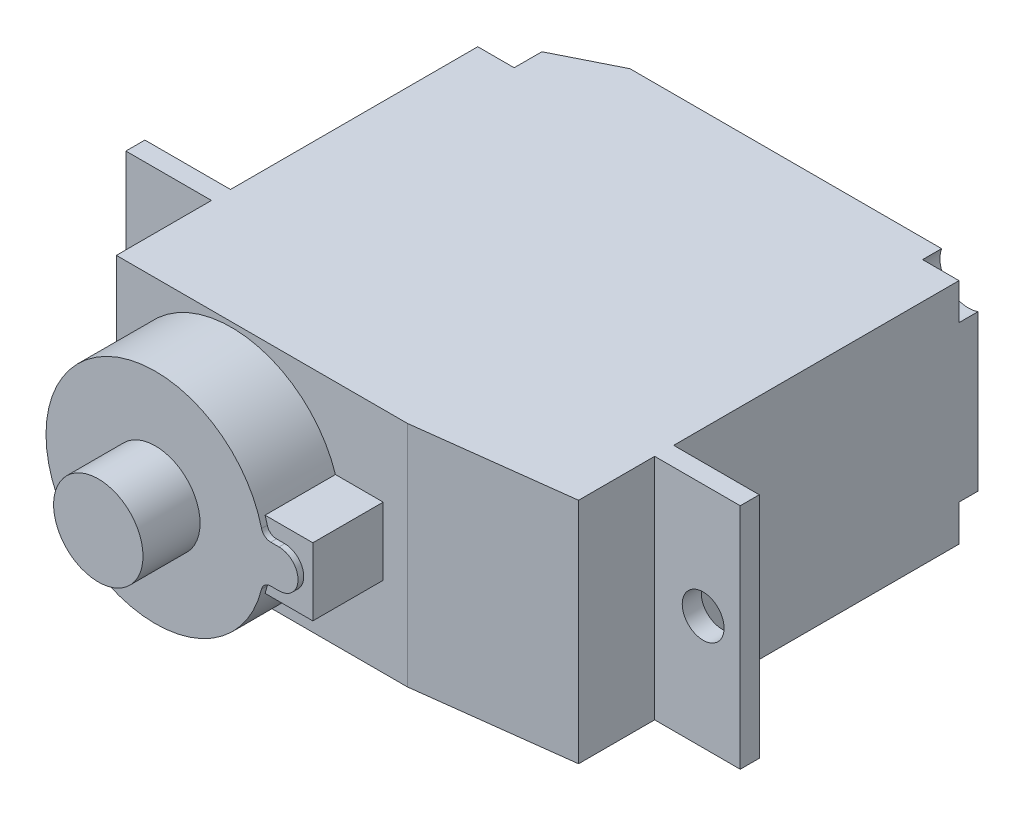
ISO-10303-21;
HEADER;
FILE_DESCRIPTION(('STEP AP214'),'2;1');
FILE_NAME('part.step','',(''),(''),'','','');
FILE_SCHEMA(('AUTOMOTIVE_DESIGN { 1 0 10303 214 1 1 1 1 }'));
ENDSEC;
DATA;
#1=APPLICATION_CONTEXT('core data for automotive mechanical design processes');
#2=APPLICATION_PROTOCOL_DEFINITION('international standard','automotive_design',2000,#1);
#3=PRODUCT_CONTEXT('',#1,'mechanical');
#4=PRODUCT('Part','Part','',(#3));
#5=PRODUCT_RELATED_PRODUCT_CATEGORY('part','',(#4));
#6=PRODUCT_DEFINITION_FORMATION('','',#4);
#7=PRODUCT_DEFINITION_CONTEXT('part definition',#1,'design');
#8=PRODUCT_DEFINITION('design','',#6,#7);
#9=PRODUCT_DEFINITION_SHAPE('','',#8);
#10=(LENGTH_UNIT() NAMED_UNIT(*) SI_UNIT(.MILLI.,.METRE.));
#11=(NAMED_UNIT(*) PLANE_ANGLE_UNIT() SI_UNIT($,.RADIAN.));
#12=(NAMED_UNIT(*) SI_UNIT($,.STERADIAN.) SOLID_ANGLE_UNIT());
#13=UNCERTAINTY_MEASURE_WITH_UNIT(LENGTH_MEASURE(1.E-05),#10,'distance_accuracy_value','');
#14=(GEOMETRIC_REPRESENTATION_CONTEXT(3) GLOBAL_UNCERTAINTY_ASSIGNED_CONTEXT((#13)) GLOBAL_UNIT_ASSIGNED_CONTEXT((#10,
#11,#12)) REPRESENTATION_CONTEXT('',''));
#15=CARTESIAN_POINT('',(0.,0.,0.));
#16=DIRECTION('',(0.,0.,1.));
#17=DIRECTION('',(1.,0.,0.));
#18=AXIS2_PLACEMENT_3D('',#15,#16,#17);
#19=CARTESIAN_POINT('',(0.467330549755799,-1.5,10.));
#20=DIRECTION('',(0.,0.,1.));
#21=DIRECTION('',(1.,0.,0.));
#22=AXIS2_PLACEMENT_3D('',#19,#20,#21);
#23=PLANE('',#22);
#24=CARTESIAN_POINT('',(0.467330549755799,-1.5,10.));
#25=DIRECTION('',(0.,0.,-1.));
#26=DIRECTION('',(1.,0.,0.));
#27=AXIS2_PLACEMENT_3D('',#24,#25,#26);
#28=CIRCLE('',#27,0.5);
#29=CARTESIAN_POINT('',(-0.018055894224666,-1.38,10.));
#30=VERTEX_POINT('',#29);
#31=CARTESIAN_POINT('',(0.467330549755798,-1.,10.));
#32=VERTEX_POINT('',#31);
#33=EDGE_CURVE('E699',#30,#32,#28,.T.);
#34=ORIENTED_EDGE('',*,*,#33,.T.);
#35=DIRECTION('',(1.,0.,0.));
#36=VECTOR('',#35,1.);
#37=CARTESIAN_POINT('',(0.9,-1.,10.));
#38=LINE('',#37,#36);
#39=CARTESIAN_POINT('',(0.9,-1.,10.));
#40=VERTEX_POINT('',#39);
#41=EDGE_CURVE('E708',#32,#40,#38,.T.);
#42=ORIENTED_EDGE('',*,*,#41,.T.);
#43=CARTESIAN_POINT('',(0.9,0.,10.));
#44=DIRECTION('',(0.,0.,1.));
#45=DIRECTION('',(1.,0.,0.));
#46=AXIS2_PLACEMENT_3D('',#43,#44,#45);
#47=CIRCLE('',#46,1.);
#48=CARTESIAN_POINT('',(0.9,1.,10.));
#49=VERTEX_POINT('',#48);
#50=EDGE_CURVE('E706',#40,#49,#47,.T.);
#51=ORIENTED_EDGE('',*,*,#50,.T.);
#52=DIRECTION('',(-1.,0.,0.));
#53=VECTOR('',#52,1.);
#54=CARTESIAN_POINT('',(0.9,1.,10.));
#55=LINE('',#54,#53);
#56=CARTESIAN_POINT('',(0.467330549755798,1.,10.));
#57=VERTEX_POINT('',#56);
#58=EDGE_CURVE('E704',#49,#57,#55,.T.);
#59=ORIENTED_EDGE('',*,*,#58,.T.);
#60=CARTESIAN_POINT('',(0.467330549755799,1.5,10.));
#61=DIRECTION('',(0.,0.,-1.));
#62=DIRECTION('',(-1.,0.,0.));
#63=AXIS2_PLACEMENT_3D('',#60,#61,#62);
#64=CIRCLE('',#63,0.5);
#65=CARTESIAN_POINT('',(-0.0180558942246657,1.38,10.));
#66=VERTEX_POINT('',#65);
#67=EDGE_CURVE('E702',#57,#66,#64,.T.);
#68=ORIENTED_EDGE('',*,*,#67,.T.);
#69=CARTESIAN_POINT('',(-5.6,0.,10.));
#70=DIRECTION('',(0.,0.,1.));
#71=DIRECTION('',(1.,0.,0.));
#72=AXIS2_PLACEMENT_3D('',#69,#70,#71);
#73=CIRCLE('',#72,5.75);
#74=EDGE_CURVE('E695',#66,#30,#73,.T.);
#75=ORIENTED_EDGE('',*,*,#74,.T.);
#76=EDGE_LOOP('',(#34,#42,#51,#59,#68,#75));
#77=FACE_BOUND('',#76,.T.);
#78=CARTESIAN_POINT('',(-5.59999999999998,0.,10.));
#79=DIRECTION('',(0.,0.,1.));
#80=DIRECTION('',(1.,0.,0.));
#81=AXIS2_PLACEMENT_3D('',#78,#79,#80);
#82=CIRCLE('',#81,2.35);
#83=CARTESIAN_POINT('',(-3.24999999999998,0.,10.));
#84=VERTEX_POINT('',#83);
#85=EDGE_CURVE('E405',#84,#84,#82,.T.);
#86=ORIENTED_EDGE('',*,*,#85,.F.);
#87=EDGE_LOOP('',(#86));
#88=FACE_BOUND('',#87,.T.);
#89=ADVANCED_FACE('F34',(#77,#88),#23,.T.);
#90=CARTESIAN_POINT('',(11.65,6.,0.));
#91=DIRECTION('',(0.,0.,-1.));
#92=DIRECTION('',(-1.,0.,0.));
#93=AXIS2_PLACEMENT_3D('',#90,#91,#92);
#94=PLANE('',#93);
#95=DIRECTION('',(0.,-1.,0.));
#96=VECTOR('',#95,1.);
#97=CARTESIAN_POINT('',(11.65,6.,0.));
#98=LINE('',#97,#96);
#99=CARTESIAN_POINT('',(11.65,6.,0.));
#100=VERTEX_POINT('',#99);
#101=CARTESIAN_POINT('',(11.65,-6.,0.));
#102=VERTEX_POINT('',#101);
#103=EDGE_CURVE('E355',#100,#102,#98,.T.);
#104=ORIENTED_EDGE('',*,*,#103,.F.);
#105=DIRECTION('',(-1.,0.,0.));
#106=VECTOR('',#105,1.);
#107=CARTESIAN_POINT('',(-11.65,6.,0.));
#108=LINE('',#107,#106);
#109=CARTESIAN_POINT('',(16.15,6.,0.));
#110=VERTEX_POINT('',#109);
#111=EDGE_CURVE('E546',#110,#100,#108,.T.);
#112=ORIENTED_EDGE('',*,*,#111,.F.);
#113=DIRECTION('',(0.,1.,0.));
#114=VECTOR('',#113,1.);
#115=CARTESIAN_POINT('',(16.15,6.,0.));
#116=LINE('',#115,#114);
#117=CARTESIAN_POINT('',(16.15,-6.,0.));
#118=VERTEX_POINT('',#117);
#119=EDGE_CURVE('E587',#118,#110,#116,.T.);
#120=ORIENTED_EDGE('',*,*,#119,.F.);
#121=DIRECTION('',(1.,0.,0.));
#122=VECTOR('',#121,1.);
#123=CARTESIAN_POINT('',(-11.65,-6.,0.));
#124=LINE('',#123,#122);
#125=EDGE_CURVE('E369',#102,#118,#124,.T.);
#126=ORIENTED_EDGE('',*,*,#125,.F.);
#127=EDGE_LOOP('',(#104,#112,#120,#126));
#128=FACE_BOUND('',#127,.T.);
#129=CARTESIAN_POINT('',(14.2,0.,0.));
#130=DIRECTION('',(0.,0.,-1.));
#131=DIRECTION('',(-1.,0.,0.));
#132=AXIS2_PLACEMENT_3D('',#129,#130,#131);
#133=CIRCLE('',#132,1.1);
#134=CARTESIAN_POINT('',(13.1,0.,0.));
#135=VERTEX_POINT('',#134);
#136=EDGE_CURVE('E662',#135,#135,#133,.T.);
#137=ORIENTED_EDGE('',*,*,#136,.F.);
#138=EDGE_LOOP('',(#137));
#139=FACE_BOUND('',#138,.T.);
#140=ADVANCED_FACE('F420',(#128,#139),#94,.T.);
#141=CARTESIAN_POINT('',(11.65,6.,6.));
#142=DIRECTION('',(0.,0.,-1.));
#143=DIRECTION('',(-1.,0.,0.));
#144=AXIS2_PLACEMENT_3D('',#141,#142,#143);
#145=PLANE('',#144);
#146=DIRECTION('',(1.,0.,0.));
#147=VECTOR('',#146,1.);
#148=CARTESIAN_POINT('',(-11.65,-6.,6.));
#149=LINE('',#148,#147);
#150=CARTESIAN_POINT('',(-11.65,-6.,6.));
#151=VERTEX_POINT('',#150);
#152=CARTESIAN_POINT('',(3.65,-6.,6.));
#153=VERTEX_POINT('',#152);
#154=EDGE_CURVE('E560',#151,#153,#149,.T.);
#155=ORIENTED_EDGE('',*,*,#154,.T.);
#156=DIRECTION('',(0.,1.,0.));
#157=VECTOR('',#156,1.);
#158=CARTESIAN_POINT('',(3.65,6.,6.));
#159=LINE('',#158,#157);
#160=CARTESIAN_POINT('',(3.65,6.,6.));
#161=VERTEX_POINT('',#160);
#162=EDGE_CURVE('E763',#153,#161,#159,.T.);
#163=ORIENTED_EDGE('',*,*,#162,.T.);
#164=DIRECTION('',(-1.,0.,0.));
#165=VECTOR('',#164,1.);
#166=CARTESIAN_POINT('',(-11.65,6.,6.));
#167=LINE('',#166,#165);
#168=CARTESIAN_POINT('',(-11.65,6.,6.));
#169=VERTEX_POINT('',#168);
#170=EDGE_CURVE('E569',#161,#169,#167,.T.);
#171=ORIENTED_EDGE('',*,*,#170,.T.);
#172=DIRECTION('',(0.,-1.,0.));
#173=VECTOR('',#172,1.);
#174=CARTESIAN_POINT('',(-11.65,-6.,6.));
#175=LINE('',#174,#173);
#176=EDGE_CURVE('E572',#169,#151,#175,.T.);
#177=ORIENTED_EDGE('',*,*,#176,.T.);
#178=EDGE_LOOP('',(#155,#163,#171,#177));
#179=FACE_BOUND('',#178,.T.);
#180=DIRECTION('',(-1.,0.,0.));
#181=VECTOR('',#180,1.);
#182=CARTESIAN_POINT('',(-0.333342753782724,1.77889036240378,6.));
#183=LINE('',#182,#181);
#184=CARTESIAN_POINT('',(2.3789392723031,1.77889036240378,6.));
#185=VERTEX_POINT('',#184);
#186=CARTESIAN_POINT('',(-0.13208914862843,1.77889036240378,6.));
#187=VERTEX_POINT('',#186);
#188=EDGE_CURVE('E736',#185,#187,#183,.T.);
#189=ORIENTED_EDGE('',*,*,#188,.F.);
#190=DIRECTION('',(0.,1.,0.));
#191=VECTOR('',#190,1.);
#192=CARTESIAN_POINT('',(2.3789392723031,-1.77889036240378,6.));
#193=LINE('',#192,#191);
#194=CARTESIAN_POINT('',(2.3789392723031,-1.77889036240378,6.));
#195=VERTEX_POINT('',#194);
#196=EDGE_CURVE('E388',#195,#185,#193,.T.);
#197=ORIENTED_EDGE('',*,*,#196,.F.);
#198=DIRECTION('',(1.,0.,0.));
#199=VECTOR('',#198,1.);
#200=CARTESIAN_POINT('',(-0.333342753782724,-1.77889036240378,6.));
#201=LINE('',#200,#199);
#202=CARTESIAN_POINT('',(-0.13208914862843,-1.77889036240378,6.));
#203=VERTEX_POINT('',#202);
#204=EDGE_CURVE('E732',#203,#195,#201,.T.);
#205=ORIENTED_EDGE('',*,*,#204,.F.);
#206=CARTESIAN_POINT('',(-5.6,0.,6.));
#207=DIRECTION('',(0.,0.,1.));
#208=DIRECTION('',(1.,0.,0.));
#209=AXIS2_PLACEMENT_3D('',#206,#207,#208);
#210=CIRCLE('',#209,5.75);
#211=EDGE_CURVE('E696',#187,#203,#210,.T.);
#212=ORIENTED_EDGE('',*,*,#211,.F.);
#213=EDGE_LOOP('',(#189,#197,#205,#212));
#214=FACE_BOUND('',#213,.T.);
#215=ADVANCED_FACE('F426',(#179,#214),#145,.F.);
#216=CARTESIAN_POINT('',(0.467330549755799,-1.5,10.));
#217=DIRECTION('',(0.,0.,-1.));
#218=DIRECTION('',(-1.,0.,0.));
#219=AXIS2_PLACEMENT_3D('',#216,#217,#218);
#220=CYLINDRICAL_SURFACE('',#219,0.5);
#221=CARTESIAN_POINT('',(0.467330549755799,-1.5,9.7));
#222=DIRECTION('',(0.,0.,-1.));
#223=DIRECTION('',(-1.,0.,0.));
#224=AXIS2_PLACEMENT_3D('',#221,#222,#223);
#225=CIRCLE('',#224,0.5);
#226=CARTESIAN_POINT('',(0.467330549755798,-1.,9.7));
#227=VERTEX_POINT('',#226);
#228=CARTESIAN_POINT('',(-0.018055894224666,-1.38,9.7));
#229=VERTEX_POINT('',#228);
#230=EDGE_CURVE('E722',#227,#229,#225,.F.);
#231=ORIENTED_EDGE('',*,*,#230,.F.);
#232=DIRECTION('',(0.,0.,-1.));
#233=VECTOR('',#232,1.);
#234=CARTESIAN_POINT('',(0.467330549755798,-1.,10.));
#235=LINE('',#234,#233);
#236=EDGE_CURVE('E677',#32,#227,#235,.T.);
#237=ORIENTED_EDGE('',*,*,#236,.F.);
#238=ORIENTED_EDGE('',*,*,#33,.F.);
#239=DIRECTION('',(0.,0.,-1.));
#240=VECTOR('',#239,1.);
#241=CARTESIAN_POINT('',(-0.018055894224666,-1.38,10.));
#242=LINE('',#241,#240);
#243=EDGE_CURVE('E692',#30,#229,#242,.T.);
#244=ORIENTED_EDGE('',*,*,#243,.T.);
#245=EDGE_LOOP('',(#231,#237,#238,#244));
#246=FACE_BOUND('',#245,.T.);
#247=ADVANCED_FACE('F455',(#246),#220,.F.);
#248=CARTESIAN_POINT('',(0.9,-1.,10.));
#249=DIRECTION('',(0.,1.,0.));
#250=DIRECTION('',(-1.,0.,0.));
#251=AXIS2_PLACEMENT_3D('',#248,#249,#250);
#252=PLANE('',#251);
#253=DIRECTION('',(-1.,0.,0.));
#254=VECTOR('',#253,1.);
#255=CARTESIAN_POINT('',(0.9,-1.,9.7));
#256=LINE('',#255,#254);
#257=CARTESIAN_POINT('',(0.9,-1.,9.7));
#258=VERTEX_POINT('',#257);
#259=EDGE_CURVE('E719',#258,#227,#256,.T.);
#260=ORIENTED_EDGE('',*,*,#259,.F.);
#261=DIRECTION('',(0.,0.,-1.));
#262=VECTOR('',#261,1.);
#263=CARTESIAN_POINT('',(0.9,-1.,10.));
#264=LINE('',#263,#262);
#265=EDGE_CURVE('E680',#40,#258,#264,.T.);
#266=ORIENTED_EDGE('',*,*,#265,.F.);
#267=ORIENTED_EDGE('',*,*,#41,.F.);
#268=ORIENTED_EDGE('',*,*,#236,.T.);
#269=EDGE_LOOP('',(#260,#266,#267,#268));
#270=FACE_BOUND('',#269,.T.);
#271=ADVANCED_FACE('F451',(#270),#252,.F.);
#272=CARTESIAN_POINT('',(0.9,0.,10.));
#273=DIRECTION('',(0.,0.,-1.));
#274=DIRECTION('',(-1.,0.,0.));
#275=AXIS2_PLACEMENT_3D('',#272,#273,#274);
#276=CYLINDRICAL_SURFACE('',#275,1.);
#277=CARTESIAN_POINT('',(0.9,0.,9.7));
#278=DIRECTION('',(0.,0.,-1.));
#279=DIRECTION('',(-1.,0.,0.));
#280=AXIS2_PLACEMENT_3D('',#277,#278,#279);
#281=CIRCLE('',#280,1.);
#282=CARTESIAN_POINT('',(0.9,1.,9.7));
#283=VERTEX_POINT('',#282);
#284=EDGE_CURVE('E716',#283,#258,#281,.T.);
#285=ORIENTED_EDGE('',*,*,#284,.F.);
#286=DIRECTION('',(0.,0.,-1.));
#287=VECTOR('',#286,1.);
#288=CARTESIAN_POINT('',(0.9,1.,10.));
#289=LINE('',#288,#287);
#290=EDGE_CURVE('E683',#49,#283,#289,.T.);
#291=ORIENTED_EDGE('',*,*,#290,.F.);
#292=ORIENTED_EDGE('',*,*,#50,.F.);
#293=ORIENTED_EDGE('',*,*,#265,.T.);
#294=EDGE_LOOP('',(#285,#291,#292,#293));
#295=FACE_BOUND('',#294,.T.);
#296=ADVANCED_FACE('F447',(#295),#276,.T.);
#297=CARTESIAN_POINT('',(0.9,1.,10.));
#298=DIRECTION('',(0.,-1.,0.));
#299=DIRECTION('',(1.,0.,0.));
#300=AXIS2_PLACEMENT_3D('',#297,#298,#299);
#301=PLANE('',#300);
#302=DIRECTION('',(1.,0.,0.));
#303=VECTOR('',#302,1.);
#304=CARTESIAN_POINT('',(0.9,1.,9.7));
#305=LINE('',#304,#303);
#306=CARTESIAN_POINT('',(0.467330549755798,1.,9.7));
#307=VERTEX_POINT('',#306);
#308=EDGE_CURVE('E713',#307,#283,#305,.T.);
#309=ORIENTED_EDGE('',*,*,#308,.F.);
#310=DIRECTION('',(0.,0.,-1.));
#311=VECTOR('',#310,1.);
#312=CARTESIAN_POINT('',(0.467330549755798,1.,10.));
#313=LINE('',#312,#311);
#314=EDGE_CURVE('E686',#57,#307,#313,.T.);
#315=ORIENTED_EDGE('',*,*,#314,.F.);
#316=ORIENTED_EDGE('',*,*,#58,.F.);
#317=ORIENTED_EDGE('',*,*,#290,.T.);
#318=EDGE_LOOP('',(#309,#315,#316,#317));
#319=FACE_BOUND('',#318,.T.);
#320=ADVANCED_FACE('F443',(#319),#301,.F.);
#321=CARTESIAN_POINT('',(0.467330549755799,1.5,10.));
#322=DIRECTION('',(0.,0.,-1.));
#323=DIRECTION('',(-1.,0.,0.));
#324=AXIS2_PLACEMENT_3D('',#321,#322,#323);
#325=CYLINDRICAL_SURFACE('',#324,0.5);
#326=CARTESIAN_POINT('',(0.467330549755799,1.5,9.7));
#327=DIRECTION('',(0.,0.,-1.));
#328=DIRECTION('',(-1.,0.,0.));
#329=AXIS2_PLACEMENT_3D('',#326,#327,#328);
#330=CIRCLE('',#329,0.5);
#331=CARTESIAN_POINT('',(-0.0180558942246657,1.38,9.7));
#332=VERTEX_POINT('',#331);
#333=EDGE_CURVE('E700',#332,#307,#330,.F.);
#334=ORIENTED_EDGE('',*,*,#333,.F.);
#335=DIRECTION('',(0.,0.,-1.));
#336=VECTOR('',#335,1.);
#337=CARTESIAN_POINT('',(-0.0180558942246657,1.38,10.));
#338=LINE('',#337,#336);
#339=EDGE_CURVE('E689',#66,#332,#338,.T.);
#340=ORIENTED_EDGE('',*,*,#339,.F.);
#341=ORIENTED_EDGE('',*,*,#67,.F.);
#342=ORIENTED_EDGE('',*,*,#314,.T.);
#343=EDGE_LOOP('',(#334,#340,#341,#342));
#344=FACE_BOUND('',#343,.T.);
#345=ADVANCED_FACE('F439',(#344),#325,.F.);
#346=CARTESIAN_POINT('',(-5.6,0.,10.));
#347=DIRECTION('',(0.,0.,-1.));
#348=DIRECTION('',(-1.,0.,0.));
#349=AXIS2_PLACEMENT_3D('',#346,#347,#348);
#350=CYLINDRICAL_SURFACE('',#349,5.75);
#351=DIRECTION('',(0.,0.,-1.));
#352=VECTOR('',#351,1.);
#353=CARTESIAN_POINT('',(-0.13208914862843,1.77889036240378,10.));
#354=LINE('',#353,#352);
#355=CARTESIAN_POINT('',(-0.13208914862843,1.77889036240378,9.7));
#356=VERTEX_POINT('',#355);
#357=EDGE_CURVE('E521',#187,#356,#354,.F.);
#358=ORIENTED_EDGE('',*,*,#357,.F.);
#359=ORIENTED_EDGE('',*,*,#211,.T.);
#360=DIRECTION('',(0.,0.,-1.));
#361=VECTOR('',#360,1.);
#362=CARTESIAN_POINT('',(-0.13208914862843,-1.77889036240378,10.));
#363=LINE('',#362,#361);
#364=CARTESIAN_POINT('',(-0.13208914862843,-1.77889036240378,9.7));
#365=VERTEX_POINT('',#364);
#366=EDGE_CURVE('E760',#365,#203,#363,.T.);
#367=ORIENTED_EDGE('',*,*,#366,.F.);
#368=CARTESIAN_POINT('',(-5.6,0.,9.7));
#369=DIRECTION('',(0.,0.,-1.));
#370=DIRECTION('',(-1.,0.,0.));
#371=AXIS2_PLACEMENT_3D('',#368,#369,#370);
#372=CIRCLE('',#371,5.75);
#373=EDGE_CURVE('E761',#229,#365,#372,.T.);
#374=ORIENTED_EDGE('',*,*,#373,.F.);
#375=ORIENTED_EDGE('',*,*,#243,.F.);
#376=ORIENTED_EDGE('',*,*,#74,.F.);
#377=ORIENTED_EDGE('',*,*,#339,.T.);
#378=EDGE_CURVE('E526',#356,#332,#372,.T.);
#379=ORIENTED_EDGE('',*,*,#378,.F.);
#380=EDGE_LOOP('',(#358,#359,#367,#374,#375,#376,#377,#379));
#381=FACE_BOUND('',#380,.T.);
#382=ADVANCED_FACE('F435',(#381),#350,.T.);
#383=CARTESIAN_POINT('',(-11.65,-6.,6.));
#384=DIRECTION('',(1.,0.,0.));
#385=DIRECTION('',(0.,0.,-1.));
#386=AXIS2_PLACEMENT_3D('',#383,#384,#385);
#387=PLANE('',#386);
#388=DIRECTION('',(0.,1.,0.));
#389=VECTOR('',#388,1.);
#390=CARTESIAN_POINT('',(-11.65,-6.,0.999999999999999));
#391=LINE('',#390,#389);
#392=CARTESIAN_POINT('',(-11.65,-6.,0.999999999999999));
#393=VERTEX_POINT('',#392);
#394=CARTESIAN_POINT('',(-11.65,6.,1.));
#395=VERTEX_POINT('',#394);
#396=EDGE_CURVE('E609',#393,#395,#391,.T.);
#397=ORIENTED_EDGE('',*,*,#396,.F.);
#398=DIRECTION('',(0.,0.,-1.));
#399=VECTOR('',#398,1.);
#400=CARTESIAN_POINT('',(-11.65,-6.,6.));
#401=LINE('',#400,#399);
#402=EDGE_CURVE('E600',#151,#393,#401,.T.);
#403=ORIENTED_EDGE('',*,*,#402,.F.);
#404=ORIENTED_EDGE('',*,*,#176,.F.);
#405=DIRECTION('',(0.,0.,-1.));
#406=VECTOR('',#405,1.);
#407=CARTESIAN_POINT('',(-11.65,6.,6.));
#408=LINE('',#407,#406);
#409=EDGE_CURVE('E603',#169,#395,#408,.T.);
#410=ORIENTED_EDGE('',*,*,#409,.T.);
#411=EDGE_LOOP('',(#397,#403,#404,#410));
#412=FACE_BOUND('',#411,.T.);
#413=ADVANCED_FACE('F438',(#412),#387,.F.);
#414=CARTESIAN_POINT('',(11.65,-6.,6.));
#415=DIRECTION('',(-1.,0.,0.));
#416=DIRECTION('',(0.,0.,1.));
#417=AXIS2_PLACEMENT_3D('',#414,#415,#416);
#418=PLANE('',#417);
#419=DIRECTION('',(0.,0.,-1.));
#420=VECTOR('',#419,1.);
#421=CARTESIAN_POINT('',(11.65,6.,6.));
#422=LINE('',#421,#420);
#423=CARTESIAN_POINT('',(11.65,6.,5.));
#424=VERTEX_POINT('',#423);
#425=CARTESIAN_POINT('',(11.65,6.,0.999999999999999));
#426=VERTEX_POINT('',#425);
#427=EDGE_CURVE('E608',#424,#426,#422,.T.);
#428=ORIENTED_EDGE('',*,*,#427,.F.);
#429=DIRECTION('',(0.,-1.,0.));
#430=VECTOR('',#429,1.);
#431=CARTESIAN_POINT('',(11.65,10.,5.));
#432=LINE('',#431,#430);
#433=CARTESIAN_POINT('',(11.65,-6.,5.));
#434=VERTEX_POINT('',#433);
#435=EDGE_CURVE('E672',#424,#434,#432,.T.);
#436=ORIENTED_EDGE('',*,*,#435,.T.);
#437=DIRECTION('',(0.,0.,-1.));
#438=VECTOR('',#437,1.);
#439=CARTESIAN_POINT('',(11.65,-6.,6.));
#440=LINE('',#439,#438);
#441=CARTESIAN_POINT('',(11.65,-6.,0.999999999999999));
#442=VERTEX_POINT('',#441);
#443=EDGE_CURVE('E604',#434,#442,#440,.T.);
#444=ORIENTED_EDGE('',*,*,#443,.T.);
#445=DIRECTION('',(0.,-1.,0.));
#446=VECTOR('',#445,1.);
#447=CARTESIAN_POINT('',(11.65,6.,1.));
#448=LINE('',#447,#446);
#449=EDGE_CURVE('E583',#426,#442,#448,.T.);
#450=ORIENTED_EDGE('',*,*,#449,.F.);
#451=EDGE_LOOP('',(#428,#436,#444,#450));
#452=FACE_BOUND('',#451,.T.);
#453=ADVANCED_FACE('F36',(#452),#418,.F.);
#454=CARTESIAN_POINT('',(-11.65,6.,6.));
#455=DIRECTION('',(0.,-1.,0.));
#456=DIRECTION('',(0.,0.,-1.));
#457=AXIS2_PLACEMENT_3D('',#454,#455,#456);
#458=PLANE('',#457);
#459=DIRECTION('',(1.,0.,0.));
#460=VECTOR('',#459,1.);
#461=CARTESIAN_POINT('',(11.65,6.,-16.));
#462=LINE('',#461,#460);
#463=CARTESIAN_POINT('',(-6.65,6.,-16.));
#464=VERTEX_POINT('',#463);
#465=CARTESIAN_POINT('',(9.7357864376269,6.,-16.));
#466=VERTEX_POINT('',#465);
#467=EDGE_CURVE('E354',#464,#466,#462,.T.);
#468=ORIENTED_EDGE('',*,*,#467,.F.);
#469=DIRECTION('',(-0.894427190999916,0.,0.447213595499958));
#470=VECTOR('',#469,1.);
#471=CARTESIAN_POINT('',(-19.45,6.,-9.60000000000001));
#472=LINE('',#471,#470);
#473=CARTESIAN_POINT('',(-9.73578643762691,6.,-14.4571067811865));
#474=VERTEX_POINT('',#473);
#475=EDGE_CURVE('E305',#464,#474,#472,.T.);
#476=ORIENTED_EDGE('',*,*,#475,.T.);
#477=DIRECTION('',(0.,0.,-1.));
#478=VECTOR('',#477,1.);
#479=CARTESIAN_POINT('',(-9.73578643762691,6.,-13.));
#480=LINE('',#479,#478);
#481=CARTESIAN_POINT('',(-9.73578643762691,6.,-13.));
#482=VERTEX_POINT('',#481);
#483=EDGE_CURVE('E323',#474,#482,#480,.F.);
#484=ORIENTED_EDGE('',*,*,#483,.T.);
#485=DIRECTION('',(1.,0.,0.));
#486=VECTOR('',#485,1.);
#487=CARTESIAN_POINT('',(-11.65,6.,-13.));
#488=LINE('',#487,#486);
#489=CARTESIAN_POINT('',(-11.65,6.,-13.));
#490=VERTEX_POINT('',#489);
#491=EDGE_CURVE('E325',#490,#482,#488,.T.);
#492=ORIENTED_EDGE('',*,*,#491,.F.);
#493=DIRECTION('',(0.,0.,1.));
#494=VECTOR('',#493,1.);
#495=CARTESIAN_POINT('',(-11.65,6.,-16.));
#496=LINE('',#495,#494);
#497=CARTESIAN_POINT('',(-11.65,6.,0.));
#498=VERTEX_POINT('',#497);
#499=EDGE_CURVE('E377',#490,#498,#496,.T.);
#500=ORIENTED_EDGE('',*,*,#499,.T.);
#501=CARTESIAN_POINT('',(-16.15,6.,0.));
#502=VERTEX_POINT('',#501);
#503=EDGE_CURVE('E551',#498,#502,#108,.T.);
#504=ORIENTED_EDGE('',*,*,#503,.T.);
#505=DIRECTION('',(0.,0.,-1.));
#506=VECTOR('',#505,1.);
#507=CARTESIAN_POINT('',(-16.15,6.,1.));
#508=LINE('',#507,#506);
#509=CARTESIAN_POINT('',(-16.15,6.,1.));
#510=VERTEX_POINT('',#509);
#511=EDGE_CURVE('E654',#510,#502,#508,.T.);
#512=ORIENTED_EDGE('',*,*,#511,.F.);
#513=DIRECTION('',(1.,0.,0.));
#514=VECTOR('',#513,1.);
#515=CARTESIAN_POINT('',(-16.15,6.,1.));
#516=LINE('',#515,#514);
#517=EDGE_CURVE('E615',#510,#395,#516,.T.);
#518=ORIENTED_EDGE('',*,*,#517,.T.);
#519=ORIENTED_EDGE('',*,*,#409,.F.);
#520=ORIENTED_EDGE('',*,*,#170,.F.);
#521=DIRECTION('',(0.992277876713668,0.,-0.124034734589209));
#522=VECTOR('',#521,1.);
#523=CARTESIAN_POINT('',(-11.4146153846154,6.,7.88307692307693));
#524=LINE('',#523,#522);
#525=EDGE_CURVE('E669',#161,#424,#524,.T.);
#526=ORIENTED_EDGE('',*,*,#525,.T.);
#527=ORIENTED_EDGE('',*,*,#427,.T.);
#528=DIRECTION('',(-1.,0.,0.));
#529=VECTOR('',#528,1.);
#530=CARTESIAN_POINT('',(16.15,6.,1.));
#531=LINE('',#530,#529);
#532=CARTESIAN_POINT('',(16.15,6.,1.));
#533=VERTEX_POINT('',#532);
#534=EDGE_CURVE('E554',#533,#426,#531,.T.);
#535=ORIENTED_EDGE('',*,*,#534,.F.);
#536=DIRECTION('',(0.,0.,1.));
#537=VECTOR('',#536,1.);
#538=CARTESIAN_POINT('',(16.15,6.,0.));
#539=LINE('',#538,#537);
#540=EDGE_CURVE('E549',#110,#533,#539,.T.);
#541=ORIENTED_EDGE('',*,*,#540,.F.);
#542=ORIENTED_EDGE('',*,*,#111,.T.);
#543=DIRECTION('',(0.,0.,1.));
#544=VECTOR('',#543,1.);
#545=CARTESIAN_POINT('',(11.65,6.,-16.));
#546=LINE('',#545,#544);
#547=CARTESIAN_POINT('',(11.65,6.,-15.));
#548=VERTEX_POINT('',#547);
#549=EDGE_CURVE('E381',#548,#100,#546,.T.);
#550=ORIENTED_EDGE('',*,*,#549,.F.);
#551=DIRECTION('',(1.,0.,0.));
#552=VECTOR('',#551,1.);
#553=CARTESIAN_POINT('',(-11.65,6.,-15.));
#554=LINE('',#553,#552);
#555=CARTESIAN_POINT('',(9.7357864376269,6.,-15.));
#556=VERTEX_POINT('',#555);
#557=EDGE_CURVE('E348',#556,#548,#554,.T.);
#558=ORIENTED_EDGE('',*,*,#557,.F.);
#559=DIRECTION('',(0.,0.,-1.));
#560=VECTOR('',#559,1.);
#561=CARTESIAN_POINT('',(9.7357864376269,6.,-15.));
#562=LINE('',#561,#560);
#563=EDGE_CURVE('E345',#556,#466,#562,.T.);
#564=ORIENTED_EDGE('',*,*,#563,.T.);
#565=EDGE_LOOP('',(#468,#476,#484,#492,#500,#504,#512,#518,#519,#520,#526,#527,#535,#541,#542,
#550,#558,#564));
#566=FACE_BOUND('',#565,.T.);
#567=ADVANCED_FACE('F497',(#566),#458,.F.);
#568=CARTESIAN_POINT('',(-11.65,-6.,6.));
#569=DIRECTION('',(0.,1.,0.));
#570=DIRECTION('',(0.,0.,1.));
#571=AXIS2_PLACEMENT_3D('',#568,#569,#570);
#572=PLANE('',#571);
#573=DIRECTION('',(0.,0.,-1.));
#574=VECTOR('',#573,1.);
#575=CARTESIAN_POINT('',(-9.73578643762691,-6.,-13.));
#576=LINE('',#575,#574);
#577=CARTESIAN_POINT('',(-9.73578643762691,-6.,-13.));
#578=VERTEX_POINT('',#577);
#579=CARTESIAN_POINT('',(-9.73578643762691,-6.,-14.4571067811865));
#580=VERTEX_POINT('',#579);
#581=EDGE_CURVE('E313',#578,#580,#576,.T.);
#582=ORIENTED_EDGE('',*,*,#581,.T.);
#583=DIRECTION('',(-0.894427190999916,0.,0.447213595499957));
#584=VECTOR('',#583,1.);
#585=CARTESIAN_POINT('',(-11.65,-6.,-13.5));
#586=LINE('',#585,#584);
#587=CARTESIAN_POINT('',(-6.65,-6.,-16.));
#588=VERTEX_POINT('',#587);
#589=EDGE_CURVE('E57',#588,#580,#586,.T.);
#590=ORIENTED_EDGE('',*,*,#589,.F.);
#591=DIRECTION('',(-1.,0.,0.));
#592=VECTOR('',#591,1.);
#593=CARTESIAN_POINT('',(-11.65,-6.,-16.));
#594=LINE('',#593,#592);
#595=CARTESIAN_POINT('',(9.7357864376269,-6.,-16.));
#596=VERTEX_POINT('',#595);
#597=EDGE_CURVE('E351',#596,#588,#594,.T.);
#598=ORIENTED_EDGE('',*,*,#597,.F.);
#599=DIRECTION('',(0.,0.,-1.));
#600=VECTOR('',#599,1.);
#601=CARTESIAN_POINT('',(9.7357864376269,-6.,-15.));
#602=LINE('',#601,#600);
#603=CARTESIAN_POINT('',(9.7357864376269,-6.,-15.));
#604=VERTEX_POINT('',#603);
#605=EDGE_CURVE('E334',#596,#604,#602,.F.);
#606=ORIENTED_EDGE('',*,*,#605,.T.);
#607=DIRECTION('',(-1.,0.,0.));
#608=VECTOR('',#607,1.);
#609=CARTESIAN_POINT('',(-11.65,-6.,-15.));
#610=LINE('',#609,#608);
#611=CARTESIAN_POINT('',(11.65,-6.,-15.));
#612=VERTEX_POINT('',#611);
#613=EDGE_CURVE('E337',#612,#604,#610,.T.);
#614=ORIENTED_EDGE('',*,*,#613,.F.);
#615=DIRECTION('',(0.,0.,1.));
#616=VECTOR('',#615,1.);
#617=CARTESIAN_POINT('',(11.65,-6.,-16.));
#618=LINE('',#617,#616);
#619=EDGE_CURVE('E360',#612,#102,#618,.T.);
#620=ORIENTED_EDGE('',*,*,#619,.T.);
#621=ORIENTED_EDGE('',*,*,#125,.T.);
#622=DIRECTION('',(0.,0.,-1.));
#623=VECTOR('',#622,1.);
#624=CARTESIAN_POINT('',(16.15,-6.,0.));
#625=LINE('',#624,#623);
#626=CARTESIAN_POINT('',(16.15,-6.,0.999999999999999));
#627=VERTEX_POINT('',#626);
#628=EDGE_CURVE('E580',#627,#118,#625,.T.);
#629=ORIENTED_EDGE('',*,*,#628,.F.);
#630=DIRECTION('',(-1.,0.,0.));
#631=VECTOR('',#630,1.);
#632=CARTESIAN_POINT('',(16.15,-6.,0.999999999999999));
#633=LINE('',#632,#631);
#634=EDGE_CURVE('E591',#627,#442,#633,.T.);
#635=ORIENTED_EDGE('',*,*,#634,.T.);
#636=ORIENTED_EDGE('',*,*,#443,.F.);
#637=DIRECTION('',(0.992277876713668,0.,-0.124034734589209));
#638=VECTOR('',#637,1.);
#639=CARTESIAN_POINT('',(3.65,-6.,6.));
#640=LINE('',#639,#638);
#641=EDGE_CURVE('E675',#153,#434,#640,.T.);
#642=ORIENTED_EDGE('',*,*,#641,.F.);
#643=ORIENTED_EDGE('',*,*,#154,.F.);
#644=ORIENTED_EDGE('',*,*,#402,.T.);
#645=DIRECTION('',(1.,0.,0.));
#646=VECTOR('',#645,1.);
#647=CARTESIAN_POINT('',(-16.15,-6.,0.999999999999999));
#648=LINE('',#647,#646);
#649=CARTESIAN_POINT('',(-16.15,-6.,0.999999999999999));
#650=VERTEX_POINT('',#649);
#651=EDGE_CURVE('E588',#650,#393,#648,.T.);
#652=ORIENTED_EDGE('',*,*,#651,.F.);
#653=DIRECTION('',(0.,0.,1.));
#654=VECTOR('',#653,1.);
#655=CARTESIAN_POINT('',(-16.15,-6.,0.));
#656=LINE('',#655,#654);
#657=CARTESIAN_POINT('',(-16.15,-6.,0.));
#658=VERTEX_POINT('',#657);
#659=EDGE_CURVE('E613',#658,#650,#656,.T.);
#660=ORIENTED_EDGE('',*,*,#659,.F.);
#661=CARTESIAN_POINT('',(-11.65,-6.,0.));
#662=VERTEX_POINT('',#661);
#663=EDGE_CURVE('E553',#658,#662,#124,.T.);
#664=ORIENTED_EDGE('',*,*,#663,.T.);
#665=DIRECTION('',(0.,0.,1.));
#666=VECTOR('',#665,1.);
#667=CARTESIAN_POINT('',(-11.65,-6.,-16.));
#668=LINE('',#667,#666);
#669=CARTESIAN_POINT('',(-11.65,-6.,-13.));
#670=VERTEX_POINT('',#669);
#671=EDGE_CURVE('E380',#670,#662,#668,.T.);
#672=ORIENTED_EDGE('',*,*,#671,.F.);
#673=DIRECTION('',(-1.,0.,0.));
#674=VECTOR('',#673,1.);
#675=CARTESIAN_POINT('',(-11.65,-6.,-13.));
#676=LINE('',#675,#674);
#677=EDGE_CURVE('E316',#578,#670,#676,.T.);
#678=ORIENTED_EDGE('',*,*,#677,.F.);
#679=EDGE_LOOP('',(#582,#590,#598,#606,#614,#620,#621,#629,#635,#636,#642,#643,#644,#652,#660,
#664,#672,#678));
#680=FACE_BOUND('',#679,.T.);
#681=ADVANCED_FACE('F493',(#680),#572,.F.);
#682=DIRECTION('',(0.,1.,0.));
#683=VECTOR('',#682,1.);
#684=CARTESIAN_POINT('',(-11.65,-6.,0.));
#685=LINE('',#684,#683);
#686=EDGE_CURVE('E350',#662,#498,#685,.T.);
#687=ORIENTED_EDGE('',*,*,#686,.F.);
#688=ORIENTED_EDGE('',*,*,#663,.F.);
#689=DIRECTION('',(0.,-1.,0.));
#690=VECTOR('',#689,1.);
#691=CARTESIAN_POINT('',(-16.15,6.,0.));
#692=LINE('',#691,#690);
#693=EDGE_CURVE('E620',#502,#658,#692,.T.);
#694=ORIENTED_EDGE('',*,*,#693,.F.);
#695=ORIENTED_EDGE('',*,*,#503,.F.);
#696=EDGE_LOOP('',(#687,#688,#694,#695));
#697=FACE_BOUND('',#696,.T.);
#698=CARTESIAN_POINT('',(-14.2,0.,0.));
#699=DIRECTION('',(0.,0.,-1.));
#700=DIRECTION('',(-1.,0.,0.));
#701=AXIS2_PLACEMENT_3D('',#698,#699,#700);
#702=CIRCLE('',#701,1.1);
#703=CARTESIAN_POINT('',(-15.3,0.,0.));
#704=VERTEX_POINT('',#703);
#705=EDGE_CURVE('E666',#704,#704,#702,.T.);
#706=ORIENTED_EDGE('',*,*,#705,.F.);
#707=EDGE_LOOP('',(#706));
#708=FACE_BOUND('',#707,.T.);
#709=ADVANCED_FACE('F429',(#697,#708),#94,.T.);
#710=CARTESIAN_POINT('',(16.15,6.,1.));
#711=DIRECTION('',(0.,0.,-1.));
#712=DIRECTION('',(0.,1.,0.));
#713=AXIS2_PLACEMENT_3D('',#710,#711,#712);
#714=PLANE('',#713);
#715=CARTESIAN_POINT('',(14.2,0.,0.999999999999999));
#716=DIRECTION('',(0.,0.,-1.));
#717=DIRECTION('',(0.,1.,0.));
#718=AXIS2_PLACEMENT_3D('',#715,#716,#717);
#719=CIRCLE('',#718,1.1);
#720=CARTESIAN_POINT('',(14.2,1.1,0.999999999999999));
#721=VERTEX_POINT('',#720);
#722=EDGE_CURVE('E614',#721,#721,#719,.T.);
#723=ORIENTED_EDGE('',*,*,#722,.T.);
#724=EDGE_LOOP('',(#723));
#725=FACE_BOUND('',#724,.T.);
#726=ORIENTED_EDGE('',*,*,#449,.T.);
#727=ORIENTED_EDGE('',*,*,#634,.F.);
#728=DIRECTION('',(0.,-1.,0.));
#729=VECTOR('',#728,1.);
#730=CARTESIAN_POINT('',(16.15,6.,1.));
#731=LINE('',#730,#729);
#732=EDGE_CURVE('E623',#533,#627,#731,.T.);
#733=ORIENTED_EDGE('',*,*,#732,.F.);
#734=ORIENTED_EDGE('',*,*,#534,.T.);
#735=EDGE_LOOP('',(#726,#727,#733,#734));
#736=FACE_BOUND('',#735,.T.);
#737=ADVANCED_FACE('F484',(#725,#736),#714,.F.);
#738=CARTESIAN_POINT('',(16.15,-6.,0.));
#739=DIRECTION('',(-1.,0.,0.));
#740=DIRECTION('',(0.,0.,1.));
#741=AXIS2_PLACEMENT_3D('',#738,#739,#740);
#742=PLANE('',#741);
#743=ORIENTED_EDGE('',*,*,#119,.T.);
#744=ORIENTED_EDGE('',*,*,#540,.T.);
#745=ORIENTED_EDGE('',*,*,#732,.T.);
#746=ORIENTED_EDGE('',*,*,#628,.T.);
#747=EDGE_LOOP('',(#743,#744,#745,#746));
#748=FACE_BOUND('',#747,.T.);
#749=ADVANCED_FACE('F480',(#748),#742,.F.);
#750=CARTESIAN_POINT('',(-16.15,-6.,0.999999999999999));
#751=DIRECTION('',(0.,0.,-1.));
#752=DIRECTION('',(0.,1.,0.));
#753=AXIS2_PLACEMENT_3D('',#750,#751,#752);
#754=PLANE('',#753);
#755=CARTESIAN_POINT('',(-14.2,0.,0.999999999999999));
#756=DIRECTION('',(0.,0.,-1.));
#757=DIRECTION('',(0.,1.,0.));
#758=AXIS2_PLACEMENT_3D('',#755,#756,#757);
#759=CIRCLE('',#758,1.1);
#760=CARTESIAN_POINT('',(-14.2,1.1,0.999999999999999));
#761=VERTEX_POINT('',#760);
#762=EDGE_CURVE('E665',#761,#761,#759,.T.);
#763=ORIENTED_EDGE('',*,*,#762,.T.);
#764=EDGE_LOOP('',(#763));
#765=FACE_BOUND('',#764,.T.);
#766=ORIENTED_EDGE('',*,*,#396,.T.);
#767=ORIENTED_EDGE('',*,*,#517,.F.);
#768=DIRECTION('',(0.,1.,0.));
#769=VECTOR('',#768,1.);
#770=CARTESIAN_POINT('',(-16.15,-6.,0.999999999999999));
#771=LINE('',#770,#769);
#772=EDGE_CURVE('E657',#650,#510,#771,.T.);
#773=ORIENTED_EDGE('',*,*,#772,.F.);
#774=ORIENTED_EDGE('',*,*,#651,.T.);
#775=EDGE_LOOP('',(#766,#767,#773,#774));
#776=FACE_BOUND('',#775,.T.);
#777=ADVANCED_FACE('F476',(#765,#776),#754,.F.);
#778=CARTESIAN_POINT('',(-16.15,-6.,0.999999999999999));
#779=DIRECTION('',(-1.,0.,0.));
#780=DIRECTION('',(0.,0.,1.));
#781=AXIS2_PLACEMENT_3D('',#778,#779,#780);
#782=PLANE('',#781);
#783=ORIENTED_EDGE('',*,*,#659,.T.);
#784=ORIENTED_EDGE('',*,*,#772,.T.);
#785=ORIENTED_EDGE('',*,*,#511,.T.);
#786=ORIENTED_EDGE('',*,*,#693,.T.);
#787=EDGE_LOOP('',(#783,#784,#785,#786));
#788=FACE_BOUND('',#787,.T.);
#789=ADVANCED_FACE('F472',(#788),#782,.T.);
#790=CARTESIAN_POINT('',(14.2,0.,4.));
#791=DIRECTION('',(0.,0.,-1.));
#792=DIRECTION('',(-1.,0.,0.));
#793=AXIS2_PLACEMENT_3D('',#790,#791,#792);
#794=CYLINDRICAL_SURFACE('',#793,1.1);
#795=ORIENTED_EDGE('',*,*,#136,.T.);
#796=EDGE_LOOP('',(#795));
#797=FACE_BOUND('',#796,.T.);
#798=ORIENTED_EDGE('',*,*,#722,.F.);
#799=EDGE_LOOP('',(#798));
#800=FACE_BOUND('',#799,.T.);
#801=ADVANCED_FACE('F468',(#797,#800),#794,.F.);
#802=CARTESIAN_POINT('',(-14.2,0.,4.));
#803=DIRECTION('',(0.,0.,-1.));
#804=DIRECTION('',(-1.,0.,0.));
#805=AXIS2_PLACEMENT_3D('',#802,#803,#804);
#806=CYLINDRICAL_SURFACE('',#805,1.1);
#807=ORIENTED_EDGE('',*,*,#705,.T.);
#808=EDGE_LOOP('',(#807));
#809=FACE_BOUND('',#808,.T.);
#810=ORIENTED_EDGE('',*,*,#762,.F.);
#811=EDGE_LOOP('',(#810));
#812=FACE_BOUND('',#811,.T.);
#813=ADVANCED_FACE('F464',(#809,#812),#806,.F.);
#814=CARTESIAN_POINT('',(3.65,10.,6.));
#815=DIRECTION('',(-0.124034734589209,0.,-0.992277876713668));
#816=DIRECTION('',(-0.992277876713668,0.,0.124034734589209));
#817=AXIS2_PLACEMENT_3D('',#814,#815,#816);
#818=PLANE('',#817);
#819=ORIENTED_EDGE('',*,*,#162,.F.);
#820=ORIENTED_EDGE('',*,*,#641,.T.);
#821=ORIENTED_EDGE('',*,*,#435,.F.);
#822=ORIENTED_EDGE('',*,*,#525,.F.);
#823=EDGE_LOOP('',(#819,#820,#821,#822));
#824=FACE_BOUND('',#823,.T.);
#825=ADVANCED_FACE('F460',(#824),#818,.F.);
#826=CARTESIAN_POINT('',(-0.333342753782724,1.77889036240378,9.7));
#827=DIRECTION('',(0.,-1.,0.));
#828=DIRECTION('',(0.,0.,-1.));
#829=AXIS2_PLACEMENT_3D('',#826,#827,#828);
#830=PLANE('',#829);
#831=ORIENTED_EDGE('',*,*,#188,.T.);
#832=ORIENTED_EDGE('',*,*,#357,.T.);
#833=DIRECTION('',(-1.,0.,0.));
#834=VECTOR('',#833,1.);
#835=CARTESIAN_POINT('',(-0.333342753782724,1.77889036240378,9.7));
#836=LINE('',#835,#834);
#837=CARTESIAN_POINT('',(2.3789392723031,1.77889036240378,9.7));
#838=VERTEX_POINT('',#837);
#839=EDGE_CURVE('E742',#838,#356,#836,.T.);
#840=ORIENTED_EDGE('',*,*,#839,.F.);
#841=DIRECTION('',(0.,0.,-1.));
#842=VECTOR('',#841,1.);
#843=CARTESIAN_POINT('',(2.3789392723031,1.77889036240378,9.7));
#844=LINE('',#843,#842);
#845=EDGE_CURVE('E725',#838,#185,#844,.T.);
#846=ORIENTED_EDGE('',*,*,#845,.T.);
#847=EDGE_LOOP('',(#831,#832,#840,#846));
#848=FACE_BOUND('',#847,.T.);
#849=ADVANCED_FACE('F463',(#848),#830,.F.);
#850=CARTESIAN_POINT('',(-0.333342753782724,-1.77889036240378,9.7));
#851=DIRECTION('',(0.,1.,0.));
#852=DIRECTION('',(0.,0.,1.));
#853=AXIS2_PLACEMENT_3D('',#850,#851,#852);
#854=PLANE('',#853);
#855=DIRECTION('',(1.,0.,0.));
#856=VECTOR('',#855,1.);
#857=CARTESIAN_POINT('',(-0.333342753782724,-1.77889036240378,9.7));
#858=LINE('',#857,#856);
#859=CARTESIAN_POINT('',(2.3789392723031,-1.77889036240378,9.7));
#860=VERTEX_POINT('',#859);
#861=EDGE_CURVE('E731',#365,#860,#858,.T.);
#862=ORIENTED_EDGE('',*,*,#861,.F.);
#863=ORIENTED_EDGE('',*,*,#366,.T.);
#864=ORIENTED_EDGE('',*,*,#204,.T.);
#865=DIRECTION('',(0.,0.,-1.));
#866=VECTOR('',#865,1.);
#867=CARTESIAN_POINT('',(2.3789392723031,-1.77889036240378,9.7));
#868=LINE('',#867,#866);
#869=EDGE_CURVE('E728',#860,#195,#868,.T.);
#870=ORIENTED_EDGE('',*,*,#869,.F.);
#871=EDGE_LOOP('',(#862,#863,#864,#870));
#872=FACE_BOUND('',#871,.T.);
#873=ADVANCED_FACE('F759',(#872),#854,.F.);
#874=CARTESIAN_POINT('',(2.3789392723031,1.77889036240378,9.7));
#875=DIRECTION('',(0.,0.,-1.));
#876=DIRECTION('',(-1.,0.,0.));
#877=AXIS2_PLACEMENT_3D('',#874,#875,#876);
#878=PLANE('',#877);
#879=ORIENTED_EDGE('',*,*,#839,.T.);
#880=ORIENTED_EDGE('',*,*,#378,.T.);
#881=ORIENTED_EDGE('',*,*,#333,.T.);
#882=ORIENTED_EDGE('',*,*,#308,.T.);
#883=ORIENTED_EDGE('',*,*,#284,.T.);
#884=ORIENTED_EDGE('',*,*,#259,.T.);
#885=ORIENTED_EDGE('',*,*,#230,.T.);
#886=ORIENTED_EDGE('',*,*,#373,.T.);
#887=ORIENTED_EDGE('',*,*,#861,.T.);
#888=DIRECTION('',(0.,1.,0.));
#889=VECTOR('',#888,1.);
#890=CARTESIAN_POINT('',(2.3789392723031,-1.77889036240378,9.7));
#891=LINE('',#890,#889);
#892=EDGE_CURVE('E735',#860,#838,#891,.T.);
#893=ORIENTED_EDGE('',*,*,#892,.T.);
#894=EDGE_LOOP('',(#879,#880,#881,#882,#883,#884,#885,#886,#887,#893));
#895=FACE_BOUND('',#894,.T.);
#896=ADVANCED_FACE('F748',(#895),#878,.F.);
#897=CARTESIAN_POINT('',(2.3789392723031,-1.77889036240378,9.7));
#898=DIRECTION('',(-1.,0.,0.));
#899=DIRECTION('',(0.,0.,1.));
#900=AXIS2_PLACEMENT_3D('',#897,#898,#899);
#901=PLANE('',#900);
#902=ORIENTED_EDGE('',*,*,#196,.T.);
#903=ORIENTED_EDGE('',*,*,#845,.F.);
#904=ORIENTED_EDGE('',*,*,#892,.F.);
#905=ORIENTED_EDGE('',*,*,#869,.T.);
#906=EDGE_LOOP('',(#902,#903,#904,#905));
#907=FACE_BOUND('',#906,.T.);
#908=ADVANCED_FACE('F433',(#907),#901,.F.);
#909=CARTESIAN_POINT('',(-11.65,-6.,-16.));
#910=DIRECTION('',(1.,0.,0.));
#911=DIRECTION('',(0.,0.,-1.));
#912=AXIS2_PLACEMENT_3D('',#909,#910,#911);
#913=PLANE('',#912);
#914=DIRECTION('',(0.,1.,0.));
#915=VECTOR('',#914,1.);
#916=CARTESIAN_POINT('',(-11.65,-1.5,-13.));
#917=LINE('',#916,#915);
#918=CARTESIAN_POINT('',(-11.65,-1.5,-13.));
#919=VERTEX_POINT('',#918);
#920=CARTESIAN_POINT('',(-11.65,1.5,-13.));
#921=VERTEX_POINT('',#920);
#922=EDGE_CURVE('E275',#919,#921,#917,.T.);
#923=ORIENTED_EDGE('',*,*,#922,.F.);
#924=DIRECTION('',(0.,0.,-1.));
#925=VECTOR('',#924,1.);
#926=CARTESIAN_POINT('',(-11.65,-1.5,-13.));
#927=LINE('',#926,#925);
#928=CARTESIAN_POINT('',(-11.65,-1.5,-13.5));
#929=VERTEX_POINT('',#928);
#930=EDGE_CURVE('E298',#919,#929,#927,.T.);
#931=ORIENTED_EDGE('',*,*,#930,.T.);
#932=DIRECTION('',(0.,-1.,0.));
#933=VECTOR('',#932,1.);
#934=CARTESIAN_POINT('',(-11.65,7.,-13.5));
#935=LINE('',#934,#933);
#936=CARTESIAN_POINT('',(-11.65,-4.08578643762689,-13.5));
#937=VERTEX_POINT('',#936);
#938=EDGE_CURVE('E301',#929,#937,#935,.T.);
#939=ORIENTED_EDGE('',*,*,#938,.T.);
#940=DIRECTION('',(0.,0.,-1.));
#941=VECTOR('',#940,1.);
#942=CARTESIAN_POINT('',(-11.65,-4.0857864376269,-13.));
#943=LINE('',#942,#941);
#944=CARTESIAN_POINT('',(-11.65,-4.0857864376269,-13.));
#945=VERTEX_POINT('',#944);
#946=EDGE_CURVE('E311',#937,#945,#943,.F.);
#947=ORIENTED_EDGE('',*,*,#946,.T.);
#948=DIRECTION('',(0.,1.,0.));
#949=VECTOR('',#948,1.);
#950=CARTESIAN_POINT('',(-11.65,-6.,-13.));
#951=LINE('',#950,#949);
#952=EDGE_CURVE('E386',#670,#945,#951,.T.);
#953=ORIENTED_EDGE('',*,*,#952,.F.);
#954=ORIENTED_EDGE('',*,*,#671,.T.);
#955=ORIENTED_EDGE('',*,*,#686,.T.);
#956=ORIENTED_EDGE('',*,*,#499,.F.);
#957=DIRECTION('',(0.,1.,0.));
#958=VECTOR('',#957,1.);
#959=CARTESIAN_POINT('',(-11.65,-6.,-13.));
#960=LINE('',#959,#958);
#961=CARTESIAN_POINT('',(-11.65,4.0857864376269,-13.));
#962=VERTEX_POINT('',#961);
#963=EDGE_CURVE('E384',#962,#490,#960,.T.);
#964=ORIENTED_EDGE('',*,*,#963,.F.);
#965=DIRECTION('',(0.,0.,-1.));
#966=VECTOR('',#965,1.);
#967=CARTESIAN_POINT('',(-11.65,4.0857864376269,-13.));
#968=LINE('',#967,#966);
#969=CARTESIAN_POINT('',(-11.65,4.08578643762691,-13.5));
#970=VERTEX_POINT('',#969);
#971=EDGE_CURVE('E321',#962,#970,#968,.T.);
#972=ORIENTED_EDGE('',*,*,#971,.T.);
#973=CARTESIAN_POINT('',(-11.65,1.5,-13.5));
#974=VERTEX_POINT('',#973);
#975=EDGE_CURVE('E289',#970,#974,#935,.T.);
#976=ORIENTED_EDGE('',*,*,#975,.T.);
#977=DIRECTION('',(0.,0.,-1.));
#978=VECTOR('',#977,1.);
#979=CARTESIAN_POINT('',(-11.65,1.5,-13.));
#980=LINE('',#979,#978);
#981=EDGE_CURVE('E49',#921,#974,#980,.T.);
#982=ORIENTED_EDGE('',*,*,#981,.F.);
#983=EDGE_LOOP('',(#923,#931,#939,#947,#953,#954,#955,#956,#964,#972,#976,#982));
#984=FACE_BOUND('',#983,.T.);
#985=ADVANCED_FACE('F287',(#984),#913,.F.);
#986=CARTESIAN_POINT('',(11.65,6.,-16.));
#987=DIRECTION('',(-1.,0.,0.));
#988=DIRECTION('',(0.,0.,1.));
#989=AXIS2_PLACEMENT_3D('',#986,#987,#988);
#990=PLANE('',#989);
#991=DIRECTION('',(0.,-1.,0.));
#992=VECTOR('',#991,1.);
#993=CARTESIAN_POINT('',(11.65,6.,-15.));
#994=LINE('',#993,#992);
#995=CARTESIAN_POINT('',(11.65,-4.0857864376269,-15.));
#996=VERTEX_POINT('',#995);
#997=EDGE_CURVE('E382',#996,#612,#994,.T.);
#998=ORIENTED_EDGE('',*,*,#997,.F.);
#999=DIRECTION('',(0.,0.,-1.));
#1000=VECTOR('',#999,1.);
#1001=CARTESIAN_POINT('',(11.65,-4.0857864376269,-15.));
#1002=LINE('',#1001,#1000);
#1003=CARTESIAN_POINT('',(11.65,-4.0857864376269,-16.));
#1004=VERTEX_POINT('',#1003);
#1005=EDGE_CURVE('E331',#996,#1004,#1002,.T.);
#1006=ORIENTED_EDGE('',*,*,#1005,.T.);
#1007=DIRECTION('',(0.,-1.,0.));
#1008=VECTOR('',#1007,1.);
#1009=CARTESIAN_POINT('',(11.65,6.,-16.));
#1010=LINE('',#1009,#1008);
#1011=CARTESIAN_POINT('',(11.65,4.0857864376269,-16.));
#1012=VERTEX_POINT('',#1011);
#1013=EDGE_CURVE('E357',#1012,#1004,#1010,.T.);
#1014=ORIENTED_EDGE('',*,*,#1013,.F.);
#1015=DIRECTION('',(0.,0.,-1.));
#1016=VECTOR('',#1015,1.);
#1017=CARTESIAN_POINT('',(11.65,4.0857864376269,-15.));
#1018=LINE('',#1017,#1016);
#1019=CARTESIAN_POINT('',(11.65,4.0857864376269,-15.));
#1020=VERTEX_POINT('',#1019);
#1021=EDGE_CURVE('E342',#1012,#1020,#1018,.F.);
#1022=ORIENTED_EDGE('',*,*,#1021,.T.);
#1023=DIRECTION('',(0.,-1.,0.));
#1024=VECTOR('',#1023,1.);
#1025=CARTESIAN_POINT('',(11.65,6.,-15.));
#1026=LINE('',#1025,#1024);
#1027=EDGE_CURVE('E520',#548,#1020,#1026,.T.);
#1028=ORIENTED_EDGE('',*,*,#1027,.F.);
#1029=ORIENTED_EDGE('',*,*,#549,.T.);
#1030=ORIENTED_EDGE('',*,*,#103,.T.);
#1031=ORIENTED_EDGE('',*,*,#619,.F.);
#1032=EDGE_LOOP('',(#998,#1006,#1014,#1022,#1028,#1029,#1030,#1031));
#1033=FACE_BOUND('',#1032,.T.);
#1034=ADVANCED_FACE('F539',(#1033),#990,.F.);
#1035=CARTESIAN_POINT('',(11.65,-6.,-16.));
#1036=DIRECTION('',(0.,0.,-1.));
#1037=DIRECTION('',(-1.,0.,0.));
#1038=AXIS2_PLACEMENT_3D('',#1035,#1036,#1037);
#1039=PLANE('',#1038);
#1040=DIRECTION('',(0.,-1.,0.));
#1041=VECTOR('',#1040,1.);
#1042=CARTESIAN_POINT('',(-6.65,7.,-16.));
#1043=LINE('',#1042,#1041);
#1044=EDGE_CURVE('E297',#464,#588,#1043,.T.);
#1045=ORIENTED_EDGE('',*,*,#1044,.F.);
#1046=ORIENTED_EDGE('',*,*,#467,.T.);
#1047=CARTESIAN_POINT('',(11.15,5.5,-16.));
#1048=DIRECTION('',(0.,0.,-1.));
#1049=DIRECTION('',(-1.,0.,0.));
#1050=AXIS2_PLACEMENT_3D('',#1047,#1048,#1049);
#1051=CIRCLE('',#1050,1.5);
#1052=EDGE_CURVE('E515',#1012,#466,#1051,.T.);
#1053=ORIENTED_EDGE('',*,*,#1052,.F.);
#1054=ORIENTED_EDGE('',*,*,#1013,.T.);
#1055=CARTESIAN_POINT('',(11.15,-5.5,-16.));
#1056=DIRECTION('',(0.,0.,-1.));
#1057=DIRECTION('',(-1.,0.,0.));
#1058=AXIS2_PLACEMENT_3D('',#1055,#1056,#1057);
#1059=CIRCLE('',#1058,1.5);
#1060=EDGE_CURVE('E523',#596,#1004,#1059,.T.);
#1061=ORIENTED_EDGE('',*,*,#1060,.F.);
#1062=ORIENTED_EDGE('',*,*,#597,.T.);
#1063=EDGE_LOOP('',(#1045,#1046,#1053,#1054,#1061,#1062));
#1064=FACE_BOUND('',#1063,.T.);
#1065=ADVANCED_FACE('F514',(#1064),#1039,.T.);
#1066=CARTESIAN_POINT('',(11.15,5.5,-15.));
#1067=DIRECTION('',(0.,0.,-1.));
#1068=DIRECTION('',(-1.,0.,0.));
#1069=AXIS2_PLACEMENT_3D('',#1066,#1067,#1068);
#1070=PLANE('',#1069);
#1071=ORIENTED_EDGE('',*,*,#557,.T.);
#1072=ORIENTED_EDGE('',*,*,#1027,.T.);
#1073=CARTESIAN_POINT('',(11.15,5.5,-15.));
#1074=DIRECTION('',(0.,0.,-1.));
#1075=DIRECTION('',(-1.,0.,0.));
#1076=AXIS2_PLACEMENT_3D('',#1073,#1074,#1075);
#1077=CIRCLE('',#1076,1.5);
#1078=EDGE_CURVE('E339',#1020,#556,#1077,.T.);
#1079=ORIENTED_EDGE('',*,*,#1078,.T.);
#1080=EDGE_LOOP('',(#1071,#1072,#1079));
#1081=FACE_BOUND('',#1080,.T.);
#1082=ADVANCED_FACE('F815',(#1081),#1070,.T.);
#1083=CARTESIAN_POINT('',(11.15,5.5,-15.));
#1084=DIRECTION('',(0.,0.,-1.));
#1085=DIRECTION('',(-1.,0.,0.));
#1086=AXIS2_PLACEMENT_3D('',#1083,#1084,#1085);
#1087=CYLINDRICAL_SURFACE('',#1086,1.5);
#1088=ORIENTED_EDGE('',*,*,#1078,.F.);
#1089=ORIENTED_EDGE('',*,*,#1021,.F.);
#1090=ORIENTED_EDGE('',*,*,#1052,.T.);
#1091=ORIENTED_EDGE('',*,*,#563,.F.);
#1092=EDGE_LOOP('',(#1088,#1089,#1090,#1091));
#1093=FACE_BOUND('',#1092,.T.);
#1094=ADVANCED_FACE('F519',(#1093),#1087,.F.);
#1095=CARTESIAN_POINT('',(11.15,-5.5,-15.));
#1096=DIRECTION('',(0.,0.,-1.));
#1097=DIRECTION('',(-1.,0.,0.));
#1098=AXIS2_PLACEMENT_3D('',#1095,#1096,#1097);
#1099=PLANE('',#1098);
#1100=ORIENTED_EDGE('',*,*,#613,.T.);
#1101=CARTESIAN_POINT('',(11.15,-5.5,-15.));
#1102=DIRECTION('',(0.,0.,-1.));
#1103=DIRECTION('',(-1.,0.,0.));
#1104=AXIS2_PLACEMENT_3D('',#1101,#1102,#1103);
#1105=CIRCLE('',#1104,1.5);
#1106=EDGE_CURVE('E328',#604,#996,#1105,.T.);
#1107=ORIENTED_EDGE('',*,*,#1106,.T.);
#1108=ORIENTED_EDGE('',*,*,#997,.T.);
#1109=EDGE_LOOP('',(#1100,#1107,#1108));
#1110=FACE_BOUND('',#1109,.T.);
#1111=ADVANCED_FACE('F633',(#1110),#1099,.T.);
#1112=CARTESIAN_POINT('',(11.15,-5.5,-15.));
#1113=DIRECTION('',(0.,0.,-1.));
#1114=DIRECTION('',(-1.,0.,0.));
#1115=AXIS2_PLACEMENT_3D('',#1112,#1113,#1114);
#1116=CYLINDRICAL_SURFACE('',#1115,1.5);
#1117=ORIENTED_EDGE('',*,*,#1060,.T.);
#1118=ORIENTED_EDGE('',*,*,#1005,.F.);
#1119=ORIENTED_EDGE('',*,*,#1106,.F.);
#1120=ORIENTED_EDGE('',*,*,#605,.F.);
#1121=EDGE_LOOP('',(#1117,#1118,#1119,#1120));
#1122=FACE_BOUND('',#1121,.T.);
#1123=ADVANCED_FACE('F635',(#1122),#1116,.F.);
#1124=CARTESIAN_POINT('',(-11.15,5.5,-13.));
#1125=DIRECTION('',(0.,0.,-1.));
#1126=DIRECTION('',(-1.,0.,0.));
#1127=AXIS2_PLACEMENT_3D('',#1124,#1125,#1126);
#1128=PLANE('',#1127);
#1129=ORIENTED_EDGE('',*,*,#491,.T.);
#1130=CARTESIAN_POINT('',(-11.15,5.5,-13.));
#1131=DIRECTION('',(0.,0.,-1.));
#1132=DIRECTION('',(-1.,0.,0.));
#1133=AXIS2_PLACEMENT_3D('',#1130,#1131,#1132);
#1134=CIRCLE('',#1133,1.5);
#1135=EDGE_CURVE('E318',#482,#962,#1134,.T.);
#1136=ORIENTED_EDGE('',*,*,#1135,.T.);
#1137=ORIENTED_EDGE('',*,*,#963,.T.);
#1138=EDGE_LOOP('',(#1129,#1136,#1137));
#1139=FACE_BOUND('',#1138,.T.);
#1140=ADVANCED_FACE('F823',(#1139),#1128,.T.);
#1141=CARTESIAN_POINT('',(-11.15,5.5,-13.));
#1142=DIRECTION('',(0.,0.,-1.));
#1143=DIRECTION('',(-1.,0.,0.));
#1144=AXIS2_PLACEMENT_3D('',#1141,#1142,#1143);
#1145=CYLINDRICAL_SURFACE('',#1144,1.5);
#1146=ORIENTED_EDGE('',*,*,#483,.F.);
#1147=CARTESIAN_POINT('',(-11.15,5.5,-13.75));
#1148=DIRECTION('',(0.447213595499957,0.,0.894427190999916));
#1149=DIRECTION('',(0.894427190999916,0.,-0.447213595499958));
#1150=AXIS2_PLACEMENT_3D('',#1147,#1148,#1149);
#1151=ELLIPSE('',#1150,1.67705098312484,1.5);
#1152=EDGE_CURVE('E300',#474,#970,#1151,.F.);
#1153=ORIENTED_EDGE('',*,*,#1152,.T.);
#1154=ORIENTED_EDGE('',*,*,#971,.F.);
#1155=ORIENTED_EDGE('',*,*,#1135,.F.);
#1156=EDGE_LOOP('',(#1146,#1153,#1154,#1155));
#1157=FACE_BOUND('',#1156,.T.);
#1158=ADVANCED_FACE('F826',(#1157),#1145,.F.);
#1159=CARTESIAN_POINT('',(-11.15,-5.5,-13.));
#1160=DIRECTION('',(0.,0.,-1.));
#1161=DIRECTION('',(-1.,0.,0.));
#1162=AXIS2_PLACEMENT_3D('',#1159,#1160,#1161);
#1163=PLANE('',#1162);
#1164=ORIENTED_EDGE('',*,*,#677,.T.);
#1165=ORIENTED_EDGE('',*,*,#952,.T.);
#1166=CARTESIAN_POINT('',(-11.15,-5.5,-13.));
#1167=DIRECTION('',(0.,0.,-1.));
#1168=DIRECTION('',(-1.,0.,0.));
#1169=AXIS2_PLACEMENT_3D('',#1166,#1167,#1168);
#1170=CIRCLE('',#1169,1.5);
#1171=EDGE_CURVE('E308',#945,#578,#1170,.T.);
#1172=ORIENTED_EDGE('',*,*,#1171,.T.);
#1173=EDGE_LOOP('',(#1164,#1165,#1172));
#1174=FACE_BOUND('',#1173,.T.);
#1175=ADVANCED_FACE('F643',(#1174),#1163,.T.);
#1176=CARTESIAN_POINT('',(-11.15,-5.5,-13.));
#1177=DIRECTION('',(0.,0.,-1.));
#1178=DIRECTION('',(-1.,0.,0.));
#1179=AXIS2_PLACEMENT_3D('',#1176,#1177,#1178);
#1180=CYLINDRICAL_SURFACE('',#1179,1.5);
#1181=ORIENTED_EDGE('',*,*,#946,.F.);
#1182=CARTESIAN_POINT('',(-11.15,-5.5,-13.75));
#1183=DIRECTION('',(0.447213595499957,0.,0.894427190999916));
#1184=DIRECTION('',(0.894427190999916,0.,-0.447213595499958));
#1185=AXIS2_PLACEMENT_3D('',#1182,#1183,#1184);
#1186=ELLIPSE('',#1185,1.67705098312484,1.5);
#1187=EDGE_CURVE('E391',#937,#580,#1186,.F.);
#1188=ORIENTED_EDGE('',*,*,#1187,.T.);
#1189=ORIENTED_EDGE('',*,*,#581,.F.);
#1190=ORIENTED_EDGE('',*,*,#1171,.F.);
#1191=EDGE_LOOP('',(#1181,#1188,#1189,#1190));
#1192=FACE_BOUND('',#1191,.T.);
#1193=ADVANCED_FACE('F641',(#1192),#1180,.F.);
#1194=CARTESIAN_POINT('',(-11.65,7.,-13.5));
#1195=DIRECTION('',(0.447213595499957,0.,0.894427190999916));
#1196=DIRECTION('',(0.894427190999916,0.,-0.447213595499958));
#1197=AXIS2_PLACEMENT_3D('',#1194,#1195,#1196);
#1198=PLANE('',#1197);
#1199=ORIENTED_EDGE('',*,*,#938,.F.);
#1200=DIRECTION('',(0.894427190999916,0.,-0.447213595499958));
#1201=VECTOR('',#1200,1.);
#1202=CARTESIAN_POINT('',(-11.65,-1.5,-13.5));
#1203=LINE('',#1202,#1201);
#1204=CARTESIAN_POINT('',(-9.65,-1.5,-14.5));
#1205=VERTEX_POINT('',#1204);
#1206=EDGE_CURVE('E11',#929,#1205,#1203,.T.);
#1207=ORIENTED_EDGE('',*,*,#1206,.T.);
#1208=DIRECTION('',(0.,1.,0.));
#1209=VECTOR('',#1208,1.);
#1210=CARTESIAN_POINT('',(-9.65,7.,-14.5));
#1211=LINE('',#1210,#1209);
#1212=CARTESIAN_POINT('',(-9.65,1.5,-14.5));
#1213=VERTEX_POINT('',#1212);
#1214=EDGE_CURVE('E42',#1205,#1213,#1211,.T.);
#1215=ORIENTED_EDGE('',*,*,#1214,.T.);
#1216=DIRECTION('',(-0.894427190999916,0.,0.447213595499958));
#1217=VECTOR('',#1216,1.);
#1218=CARTESIAN_POINT('',(-11.65,1.5,-13.5));
#1219=LINE('',#1218,#1217);
#1220=EDGE_CURVE('E393',#1213,#974,#1219,.T.);
#1221=ORIENTED_EDGE('',*,*,#1220,.T.);
#1222=ORIENTED_EDGE('',*,*,#975,.F.);
#1223=ORIENTED_EDGE('',*,*,#1152,.F.);
#1224=ORIENTED_EDGE('',*,*,#475,.F.);
#1225=ORIENTED_EDGE('',*,*,#1044,.T.);
#1226=ORIENTED_EDGE('',*,*,#589,.T.);
#1227=ORIENTED_EDGE('',*,*,#1187,.F.);
#1228=EDGE_LOOP('',(#1199,#1207,#1215,#1221,#1222,#1223,#1224,#1225,#1226,#1227));
#1229=FACE_BOUND('',#1228,.T.);
#1230=ADVANCED_FACE('F396',(#1229),#1198,.F.);
#1231=CARTESIAN_POINT('',(-9.65,-1.5,-13.));
#1232=DIRECTION('',(0.,-1.,0.));
#1233=DIRECTION('',(0.,0.,-1.));
#1234=AXIS2_PLACEMENT_3D('',#1231,#1232,#1233);
#1235=PLANE('',#1234);
#1236=ORIENTED_EDGE('',*,*,#930,.F.);
#1237=DIRECTION('',(-1.,0.,0.));
#1238=VECTOR('',#1237,1.);
#1239=CARTESIAN_POINT('',(-9.65,-1.5,-13.));
#1240=LINE('',#1239,#1238);
#1241=CARTESIAN_POINT('',(-9.65,-1.5,-13.));
#1242=VERTEX_POINT('',#1241);
#1243=EDGE_CURVE('E281',#1242,#919,#1240,.T.);
#1244=ORIENTED_EDGE('',*,*,#1243,.F.);
#1245=DIRECTION('',(0.,0.,-1.));
#1246=VECTOR('',#1245,1.);
#1247=CARTESIAN_POINT('',(-9.65,-1.5,-13.));
#1248=LINE('',#1247,#1246);
#1249=EDGE_CURVE('E291',#1242,#1205,#1248,.T.);
#1250=ORIENTED_EDGE('',*,*,#1249,.T.);
#1251=ORIENTED_EDGE('',*,*,#1206,.F.);
#1252=EDGE_LOOP('',(#1236,#1244,#1250,#1251));
#1253=FACE_BOUND('',#1252,.T.);
#1254=ADVANCED_FACE('F401',(#1253),#1235,.F.);
#1255=CARTESIAN_POINT('',(-9.65,-1.5,-13.));
#1256=DIRECTION('',(1.,0.,0.));
#1257=DIRECTION('',(0.,0.,-1.));
#1258=AXIS2_PLACEMENT_3D('',#1255,#1256,#1257);
#1259=PLANE('',#1258);
#1260=ORIENTED_EDGE('',*,*,#1249,.F.);
#1261=DIRECTION('',(0.,-1.,0.));
#1262=VECTOR('',#1261,1.);
#1263=CARTESIAN_POINT('',(-9.65,-1.5,-13.));
#1264=LINE('',#1263,#1262);
#1265=CARTESIAN_POINT('',(-9.65,1.5,-13.));
#1266=VERTEX_POINT('',#1265);
#1267=EDGE_CURVE('E274',#1266,#1242,#1264,.T.);
#1268=ORIENTED_EDGE('',*,*,#1267,.F.);
#1269=DIRECTION('',(0.,0.,-1.));
#1270=VECTOR('',#1269,1.);
#1271=CARTESIAN_POINT('',(-9.65,1.5,-13.));
#1272=LINE('',#1271,#1270);
#1273=EDGE_CURVE('E270',#1266,#1213,#1272,.T.);
#1274=ORIENTED_EDGE('',*,*,#1273,.T.);
#1275=ORIENTED_EDGE('',*,*,#1214,.F.);
#1276=EDGE_LOOP('',(#1260,#1268,#1274,#1275));
#1277=FACE_BOUND('',#1276,.T.);
#1278=ADVANCED_FACE('F399',(#1277),#1259,.F.);
#1279=CARTESIAN_POINT('',(-9.65,1.5,-13.));
#1280=DIRECTION('',(0.,1.,0.));
#1281=DIRECTION('',(0.,0.,1.));
#1282=AXIS2_PLACEMENT_3D('',#1279,#1280,#1281);
#1283=PLANE('',#1282);
#1284=ORIENTED_EDGE('',*,*,#1273,.F.);
#1285=DIRECTION('',(1.,0.,0.));
#1286=VECTOR('',#1285,1.);
#1287=CARTESIAN_POINT('',(-9.65,1.5,-13.));
#1288=LINE('',#1287,#1286);
#1289=EDGE_CURVE('E266',#921,#1266,#1288,.T.);
#1290=ORIENTED_EDGE('',*,*,#1289,.F.);
#1291=ORIENTED_EDGE('',*,*,#981,.T.);
#1292=ORIENTED_EDGE('',*,*,#1220,.F.);
#1293=EDGE_LOOP('',(#1284,#1290,#1291,#1292));
#1294=FACE_BOUND('',#1293,.T.);
#1295=ADVANCED_FACE('F268',(#1294),#1283,.F.);
#1296=CARTESIAN_POINT('',(-11.65,1.5,-13.));
#1297=DIRECTION('',(0.,0.,1.));
#1298=DIRECTION('',(1.,0.,0.));
#1299=AXIS2_PLACEMENT_3D('',#1296,#1297,#1298);
#1300=PLANE('',#1299);
#1301=ORIENTED_EDGE('',*,*,#922,.T.);
#1302=ORIENTED_EDGE('',*,*,#1289,.T.);
#1303=ORIENTED_EDGE('',*,*,#1267,.T.);
#1304=ORIENTED_EDGE('',*,*,#1243,.T.);
#1305=EDGE_LOOP('',(#1301,#1302,#1303,#1304));
#1306=FACE_BOUND('',#1305,.T.);
#1307=ADVANCED_FACE('F279',(#1306),#1300,.F.);
#1308=CARTESIAN_POINT('',(-5.59999999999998,0.,13.));
#1309=DIRECTION('',(0.,0.,-1.));
#1310=DIRECTION('',(-1.,0.,0.));
#1311=AXIS2_PLACEMENT_3D('',#1308,#1309,#1310);
#1312=CYLINDRICAL_SURFACE('',#1311,2.35);
#1313=CARTESIAN_POINT('',(-5.59999999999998,0.,13.));
#1314=DIRECTION('',(0.,0.,1.));
#1315=DIRECTION('',(1.,0.,0.));
#1316=AXIS2_PLACEMENT_3D('',#1313,#1314,#1315);
#1317=CIRCLE('',#1316,2.35);
#1318=CARTESIAN_POINT('',(-3.24999999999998,0.,13.));
#1319=VERTEX_POINT('',#1318);
#1320=EDGE_CURVE('E284',#1319,#1319,#1317,.T.);
#1321=ORIENTED_EDGE('',*,*,#1320,.F.);
#1322=EDGE_LOOP('',(#1321));
#1323=FACE_BOUND('',#1322,.T.);
#1324=ORIENTED_EDGE('',*,*,#85,.T.);
#1325=EDGE_LOOP('',(#1324));
#1326=FACE_BOUND('',#1325,.T.);
#1327=ADVANCED_FACE('F413',(#1323,#1326),#1312,.T.);
#1328=CARTESIAN_POINT('',(-5.59999999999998,0.,13.));
#1329=DIRECTION('',(0.,0.,1.));
#1330=DIRECTION('',(1.,0.,0.));
#1331=AXIS2_PLACEMENT_3D('',#1328,#1329,#1330);
#1332=PLANE('',#1331);
#1333=ORIENTED_EDGE('',*,*,#1320,.T.);
#1334=EDGE_LOOP('',(#1333));
#1335=FACE_BOUND('',#1334,.T.);
#1336=ADVANCED_FACE('F411',(#1335),#1332,.T.);
#1337=CLOSED_SHELL('',(#89,#140,#215,#247,#271,#296,#320,#345,#382,#413,#453,#567,#681,#709,
#737,#749,#777,#789,#801,#813,#825,#849,#873,#896,#908,#985,#1034,#1065,#1082,#1094,#1111,#1123,
#1140,#1158,#1175,#1193,#1230,#1254,#1278,#1295,#1307,#1327,#1336));
#1338=MANIFOLD_SOLID_BREP('B2',#1337);
#1339=ADVANCED_BREP_SHAPE_REPRESENTATION('',(#18,#1338),#14);
#1340=SHAPE_DEFINITION_REPRESENTATION(#9,#1339);
ENDSEC;
END-ISO-10303-21;
